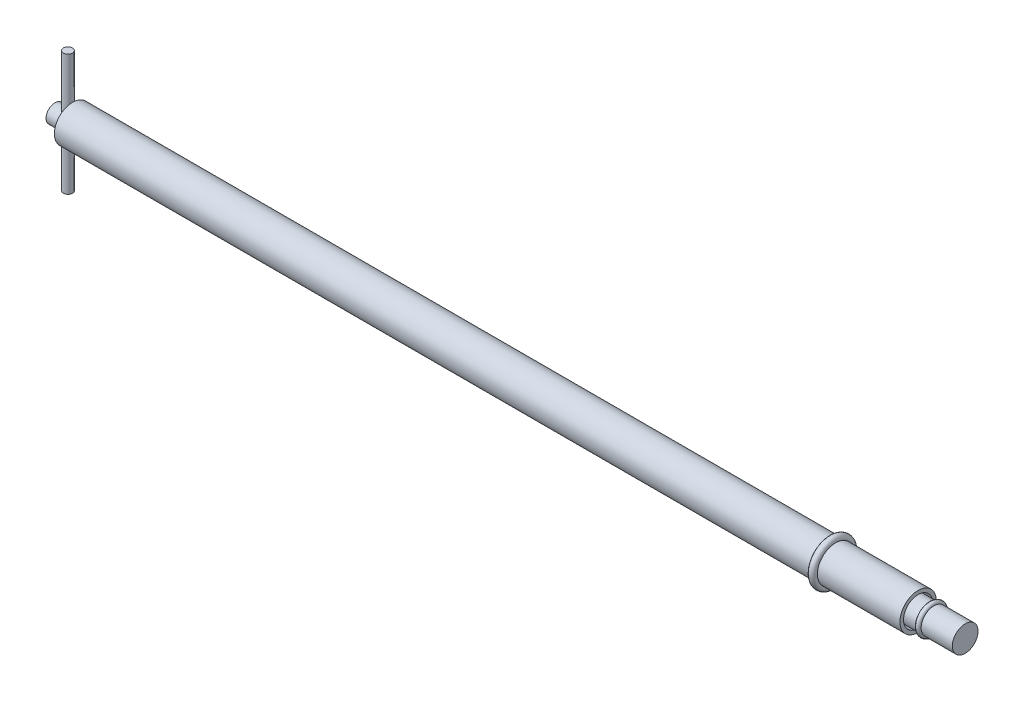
ISO-10303-21;
HEADER;
FILE_DESCRIPTION(('STEP AP214'),'2;1');
FILE_NAME('part.step','',(''),(''),'','','');
FILE_SCHEMA(('AUTOMOTIVE_DESIGN { 1 0 10303 214 1 1 1 1 }'));
ENDSEC;
DATA;
#1=APPLICATION_CONTEXT('core data for automotive mechanical design processes');
#2=APPLICATION_PROTOCOL_DEFINITION('international standard','automotive_design',2000,#1);
#3=PRODUCT_CONTEXT('',#1,'mechanical');
#4=PRODUCT('Part','Part','',(#3));
#5=PRODUCT_RELATED_PRODUCT_CATEGORY('part','',(#4));
#6=PRODUCT_DEFINITION_FORMATION('','',#4);
#7=PRODUCT_DEFINITION_CONTEXT('part definition',#1,'design');
#8=PRODUCT_DEFINITION('design','',#6,#7);
#9=PRODUCT_DEFINITION_SHAPE('','',#8);
#10=(LENGTH_UNIT() NAMED_UNIT(*) SI_UNIT(.MILLI.,.METRE.));
#11=(NAMED_UNIT(*) PLANE_ANGLE_UNIT() SI_UNIT($,.RADIAN.));
#12=(NAMED_UNIT(*) SI_UNIT($,.STERADIAN.) SOLID_ANGLE_UNIT());
#13=UNCERTAINTY_MEASURE_WITH_UNIT(LENGTH_MEASURE(1.E-05),#10,'distance_accuracy_value','');
#14=(GEOMETRIC_REPRESENTATION_CONTEXT(3) GLOBAL_UNCERTAINTY_ASSIGNED_CONTEXT((#13)) GLOBAL_UNIT_ASSIGNED_CONTEXT((#10,
#11,#12)) REPRESENTATION_CONTEXT('',''));
#15=CARTESIAN_POINT('',(0.,0.,0.));
#16=DIRECTION('',(0.,0.,1.));
#17=DIRECTION('',(1.,0.,0.));
#18=AXIS2_PLACEMENT_3D('',#15,#16,#17);
#19=CARTESIAN_POINT('',(0.,0.,0.));
#20=DIRECTION('',(1.,0.,0.));
#21=DIRECTION('',(0.,0.,-1.));
#22=AXIS2_PLACEMENT_3D('',#19,#20,#21);
#23=PLANE('',#22);
#24=CARTESIAN_POINT('',(0.,0.,0.));
#25=DIRECTION('',(-1.,0.,0.));
#26=DIRECTION('',(0.,0.,1.));
#27=AXIS2_PLACEMENT_3D('',#24,#25,#26);
#28=CIRCLE('',#27,2.96848884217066);
#29=CARTESIAN_POINT('',(0.,0.,2.96848884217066));
#30=VERTEX_POINT('',#29);
#31=EDGE_CURVE('E9',#30,#30,#28,.T.);
#32=ORIENTED_EDGE('',*,*,#31,.T.);
#33=EDGE_LOOP('',(#32));
#34=FACE_BOUND('',#33,.T.);
#35=ADVANCED_FACE('F14',(#34),#23,.F.);
#36=CARTESIAN_POINT('',(0.,0.,0.));
#37=DIRECTION('',(-1.,0.,0.));
#38=DIRECTION('',(0.,0.,1.));
#39=AXIS2_PLACEMENT_3D('',#36,#37,#38);
#40=CYLINDRICAL_SURFACE('',#39,2.96848884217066);
#41=CARTESIAN_POINT('',(4.2661907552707,-2.56162565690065,1.5));
#42=CARTESIAN_POINT('',(4.34422264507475,-2.56163267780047,1.4999944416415));
#43=CARTESIAN_POINT('',(4.42235011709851,-2.5652455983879,1.49387019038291));
#44=CARTESIAN_POINT('',(4.57619660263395,-2.57917019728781,1.46969018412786));
#45=CARTESIAN_POINT('',(4.65191032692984,-2.58949565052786,1.45160989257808));
#46=CARTESIAN_POINT('',(4.7984121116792,-2.61534051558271,1.40450365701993));
#47=CARTESIAN_POINT('',(4.86922439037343,-2.63083180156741,1.37553687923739));
#48=CARTESIAN_POINT('',(5.00496574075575,-2.66521903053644,1.3076607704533));
#49=CARTESIAN_POINT('',(5.06989438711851,-2.68411521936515,1.26875072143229));
#50=CARTESIAN_POINT('',(5.1980701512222,-2.72512943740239,1.17824574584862));
#51=CARTESIAN_POINT('',(5.26071360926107,-2.74738478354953,1.12585775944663));
#52=CARTESIAN_POINT('',(5.37679616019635,-2.79150219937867,1.01153200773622));
#53=CARTESIAN_POINT('',(5.43023057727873,-2.81336406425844,0.949589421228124));
#54=CARTESIAN_POINT('',(5.53000027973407,-2.85604040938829,0.812675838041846));
#55=CARTESIAN_POINT('',(5.57558830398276,-2.87667768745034,0.737099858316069));
#56=CARTESIAN_POINT('',(5.65312694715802,-2.91278858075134,0.57811281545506));
#57=CARTESIAN_POINT('',(5.68508635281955,-2.92826552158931,0.494706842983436));
#58=CARTESIAN_POINT('',(5.73205409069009,-2.95132082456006,0.328826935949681));
#59=CARTESIAN_POINT('',(5.74812234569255,-2.95939000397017,0.246722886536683));
#60=CARTESIAN_POINT('',(5.76634693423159,-2.96855664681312,0.0806187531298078));
#61=CARTESIAN_POINT('',(5.76851189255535,-2.96965843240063,-0.00338012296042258));
#62=CARTESIAN_POINT('',(5.75926674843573,-2.96499461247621,-0.162900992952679));
#63=CARTESIAN_POINT('',(5.74904466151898,-2.95982995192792,-0.238513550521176));
#64=CARTESIAN_POINT('',(5.71744812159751,-2.94412744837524,-0.386779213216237));
#65=CARTESIAN_POINT('',(5.69607283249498,-2.93358920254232,-0.459432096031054));
#66=CARTESIAN_POINT('',(5.64265046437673,-2.90792243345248,-0.600967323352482));
#67=CARTESIAN_POINT('',(5.6104622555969,-2.89273345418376,-0.669784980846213));
#68=CARTESIAN_POINT('',(5.53652935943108,-2.85912624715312,-0.801205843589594));
#69=CARTESIAN_POINT('',(5.49478127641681,-2.84070687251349,-0.863806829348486));
#70=CARTESIAN_POINT('',(5.39831355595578,-2.80027310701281,-0.987431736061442));
#71=CARTESIAN_POINT('',(5.34273339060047,-2.77808334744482,-1.04772730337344));
#72=CARTESIAN_POINT('',(5.22247589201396,-2.73373058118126,-1.15853905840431));
#73=CARTESIAN_POINT('',(5.15779137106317,-2.711567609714,-1.20904744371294));
#74=CARTESIAN_POINT('',(5.01595350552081,-2.66818702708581,-1.30211863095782));
#75=CARTESIAN_POINT('',(4.93825943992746,-2.64712790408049,-1.34393869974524));
#76=CARTESIAN_POINT('',(4.77563373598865,-2.61059724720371,-1.41360191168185));
#77=CARTESIAN_POINT('',(4.69070988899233,-2.59511979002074,-1.44145988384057));
#78=CARTESIAN_POINT('',(4.52314660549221,-2.5732516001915,-1.48012245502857));
#79=CARTESIAN_POINT('',(4.44086504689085,-2.5662346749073,-1.4921098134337));
#80=CARTESIAN_POINT('',(4.27518725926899,-2.56030791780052,-1.50226241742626));
#81=CARTESIAN_POINT('',(4.19179190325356,-2.56139207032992,-1.50043791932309));
#82=CARTESIAN_POINT('',(4.0363004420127,-2.57088003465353,-1.48410429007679));
#83=CARTESIAN_POINT('',(3.96399155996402,-2.57844372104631,-1.47105036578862));
#84=CARTESIAN_POINT('',(3.82273455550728,-2.5987858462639,-1.43480545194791));
#85=CARTESIAN_POINT('',(3.75378756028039,-2.61156602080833,-1.4116110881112));
#86=CARTESIAN_POINT('',(3.61758262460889,-2.64158935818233,-1.35462537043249));
#87=CARTESIAN_POINT('',(3.55054962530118,-2.65901132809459,-1.32039421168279));
#88=CARTESIAN_POINT('',(3.4227891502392,-2.69620279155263,-1.24268708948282));
#89=CARTESIAN_POINT('',(3.36206494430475,-2.71597349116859,-1.19920636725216));
#90=CARTESIAN_POINT('',(3.24042974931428,-2.75870627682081,-1.09766735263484));
#91=CARTESIAN_POINT('',(3.18050972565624,-2.78175048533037,-1.03845113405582));
#92=CARTESIAN_POINT('',(3.07113715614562,-2.82623083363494,-0.910458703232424));
#93=CARTESIAN_POINT('',(3.02168838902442,-2.84766639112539,-0.841679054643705));
#94=CARTESIAN_POINT('',(2.93345142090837,-2.88730330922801,-0.693843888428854));
#95=CARTESIAN_POINT('',(2.89500808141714,-2.90539479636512,-0.61455096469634));
#96=CARTESIAN_POINT('',(2.83239387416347,-2.93546253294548,-0.449446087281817));
#97=CARTESIAN_POINT('',(2.80821021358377,-2.94744426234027,-0.363640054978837));
#98=CARTESIAN_POINT('',(2.77692709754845,-2.96305064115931,-0.196555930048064));
#99=CARTESIAN_POINT('',(2.76844828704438,-2.96734871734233,-0.115598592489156));
#100=CARTESIAN_POINT('',(2.76472481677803,-2.96922900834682,0.046686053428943));
#101=CARTESIAN_POINT('',(2.76947531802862,-2.96681367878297,0.128013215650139));
#102=CARTESIAN_POINT('',(2.79117351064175,-2.95593044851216,0.282881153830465));
#103=CARTESIAN_POINT('',(2.80726716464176,-2.94788661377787,0.356574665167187));
#104=CARTESIAN_POINT('',(2.8500269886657,-2.92696073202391,0.500089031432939));
#105=CARTESIAN_POINT('',(2.87669464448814,-2.91407800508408,0.569909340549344));
#106=CARTESIAN_POINT('',(2.94100554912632,-2.88395591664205,0.70700699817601));
#107=CARTESIAN_POINT('',(2.97906392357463,-2.86655585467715,0.774053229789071));
#108=CARTESIAN_POINT('',(3.06455784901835,-2.82919949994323,0.901081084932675));
#109=CARTESIAN_POINT('',(3.11199768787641,-2.80924203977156,0.961059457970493));
#110=CARTESIAN_POINT('',(3.2204757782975,-2.76635443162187,1.0786621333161));
#111=CARTESIAN_POINT('',(3.28240495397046,-2.74332800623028,1.13543169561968));
#112=CARTESIAN_POINT('',(3.41521608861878,-2.69855126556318,1.23810027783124));
#113=CARTESIAN_POINT('',(3.48610617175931,-2.67680213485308,1.28398932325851));
#114=CARTESIAN_POINT('',(3.63807370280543,-2.63645767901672,1.36496837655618));
#115=CARTESIAN_POINT('',(3.71942032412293,-2.61799889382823,1.39962566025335));
#116=CARTESIAN_POINT('',(3.88798624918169,-2.5880823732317,1.45421765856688));
#117=CARTESIAN_POINT('',(3.97518486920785,-2.57660128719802,1.47420152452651));
#118=CARTESIAN_POINT('',(4.09717142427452,-2.56697512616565,1.49083314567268));
#119=CARTESIAN_POINT('',(4.13084530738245,-2.56497652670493,1.49426512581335));
#120=CARTESIAN_POINT('',(4.1984036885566,-2.56230022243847,1.49884983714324));
#121=CARTESIAN_POINT('',(4.23228820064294,-2.56162260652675,1.50000241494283));
#122=CARTESIAN_POINT('',(4.2661907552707,-2.56162565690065,1.5));
#123=B_SPLINE_CURVE_WITH_KNOTS('',3,(#41,#42,#43,#44,#45,#46,#47,#48,#49,#50,#51,#52,#53,#54,
#55,#56,#57,#58,#59,#60,#61,#62,#63,#64,#65,#66,#67,#68,#69,#70,#71,#72,#73,#74,#75,#76,#77,#78,
#79,#80,#81,#82,#83,#84,#85,#86,#87,#88,#89,#90,#91,#92,#93,#94,#95,#96,#97,#98,#99,#100,#101,
#102,#103,#104,#105,#106,#107,#108,#109,#110,#111,#112,#113,#114,#115,#116,#117,#118,#119,#120,
#121,#122),.UNSPECIFIED.,.T.,.F.,(4,2,2,2,2,2,2,2,2,2,2,2,2,2,2,2,2,2,2,2,2,2,2,2,2,2,2,2,2,2,2,
2,2,2,2,2,2,2,2,2,4),(0.,0.233952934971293,0.468387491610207,0.701565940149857,
0.934761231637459,1.18762397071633,1.44061472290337,1.71111458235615,1.98143977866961,
2.2321892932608,2.48278324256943,2.71113163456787,2.93949714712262,3.17096723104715,
3.40251966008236,3.65630154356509,3.91028491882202,4.18100181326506,4.45143056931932,
4.70029410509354,4.94897285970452,5.16957851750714,5.39025763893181,5.62112511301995,
5.85211165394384,6.11296325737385,6.37390883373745,6.64230820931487,6.91046642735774,
7.15369256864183,7.39682975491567,7.62338321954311,7.84996852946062,8.08610136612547,
8.32234237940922,8.58252752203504,8.8429502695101,9.1124607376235,9.38106425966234,
9.48270307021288,9.58434872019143),.UNSPECIFIED.);
#124=CARTESIAN_POINT('',(4.2661907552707,-2.56162565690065,1.5));
#125=VERTEX_POINT('',#124);
#126=EDGE_CURVE('E17',#125,#125,#123,.T.);
#127=ORIENTED_EDGE('',*,*,#126,.T.);
#128=EDGE_LOOP('',(#127));
#129=FACE_BOUND('',#128,.T.);
#130=CARTESIAN_POINT('',(4.2661907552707,2.56162565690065,1.5));
#131=CARTESIAN_POINT('',(4.18815886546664,2.56163267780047,1.4999944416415));
#132=CARTESIAN_POINT('',(4.11003139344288,2.5652455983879,1.49387019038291));
#133=CARTESIAN_POINT('',(3.95618490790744,2.57917019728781,1.46969018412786));
#134=CARTESIAN_POINT('',(3.88047118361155,2.58949565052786,1.45160989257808));
#135=CARTESIAN_POINT('',(3.73396939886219,2.61534051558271,1.40450365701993));
#136=CARTESIAN_POINT('',(3.66315712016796,2.63083180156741,1.37553687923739));
#137=CARTESIAN_POINT('',(3.52741576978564,2.66521903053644,1.3076607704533));
#138=CARTESIAN_POINT('',(3.46248712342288,2.68411521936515,1.26875072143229));
#139=CARTESIAN_POINT('',(3.33431135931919,2.72512943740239,1.17824574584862));
#140=CARTESIAN_POINT('',(3.27166790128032,2.74738478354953,1.12585775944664));
#141=CARTESIAN_POINT('',(3.15558535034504,2.79150219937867,1.01153200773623));
#142=CARTESIAN_POINT('',(3.10215093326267,2.81336406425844,0.949589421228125));
#143=CARTESIAN_POINT('',(3.00238123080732,2.85604040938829,0.812675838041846));
#144=CARTESIAN_POINT('',(2.95679320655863,2.87667768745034,0.73709985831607));
#145=CARTESIAN_POINT('',(2.87925456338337,2.91278858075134,0.578112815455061));
#146=CARTESIAN_POINT('',(2.84729515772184,2.92826552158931,0.494706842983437));
#147=CARTESIAN_POINT('',(2.8003274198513,2.95132082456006,0.328826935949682));
#148=CARTESIAN_POINT('',(2.78425916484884,2.95939000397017,0.246722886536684));
#149=CARTESIAN_POINT('',(2.7660345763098,2.96855664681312,0.0806187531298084));
#150=CARTESIAN_POINT('',(2.76386961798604,2.96965843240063,-0.00338012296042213));
#151=CARTESIAN_POINT('',(2.77311476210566,2.96499461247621,-0.162900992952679));
#152=CARTESIAN_POINT('',(2.78333684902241,2.95982995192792,-0.238513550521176));
#153=CARTESIAN_POINT('',(2.81493338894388,2.94412744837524,-0.386779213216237));
#154=CARTESIAN_POINT('',(2.83630867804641,2.93358920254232,-0.459432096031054));
#155=CARTESIAN_POINT('',(2.88973104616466,2.90792243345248,-0.600967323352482));
#156=CARTESIAN_POINT('',(2.92191925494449,2.89273345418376,-0.669784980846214));
#157=CARTESIAN_POINT('',(2.99585215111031,2.85912624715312,-0.801205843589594));
#158=CARTESIAN_POINT('',(3.03760023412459,2.84070687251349,-0.863806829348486));
#159=CARTESIAN_POINT('',(3.13406795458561,2.80027310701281,-0.987431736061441));
#160=CARTESIAN_POINT('',(3.18964811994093,2.77808334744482,-1.04772730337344));
#161=CARTESIAN_POINT('',(3.30990561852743,2.73373058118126,-1.15853905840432));
#162=CARTESIAN_POINT('',(3.37459013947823,2.711567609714,-1.20904744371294));
#163=CARTESIAN_POINT('',(3.51642800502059,2.66818702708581,-1.30211863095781));
#164=CARTESIAN_POINT('',(3.59412207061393,2.64712790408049,-1.34393869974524));
#165=CARTESIAN_POINT('',(3.75674777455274,2.6105972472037,-1.41360191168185));
#166=CARTESIAN_POINT('',(3.84167162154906,2.59511979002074,-1.44145988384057));
#167=CARTESIAN_POINT('',(4.00923490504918,2.5732516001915,-1.48012245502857));
#168=CARTESIAN_POINT('',(4.09151646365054,2.5662346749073,-1.4921098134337));
#169=CARTESIAN_POINT('',(4.2571942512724,2.56030791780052,-1.50226241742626));
#170=CARTESIAN_POINT('',(4.34058960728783,2.56139207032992,-1.50043791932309));
#171=CARTESIAN_POINT('',(4.49608106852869,2.57088003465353,-1.48410429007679));
#172=CARTESIAN_POINT('',(4.56838995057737,2.57844372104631,-1.47105036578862));
#173=CARTESIAN_POINT('',(4.70964695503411,2.59878584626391,-1.43480545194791));
#174=CARTESIAN_POINT('',(4.77859395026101,2.61156602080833,-1.4116110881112));
#175=CARTESIAN_POINT('',(4.9147988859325,2.64158935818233,-1.35462537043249));
#176=CARTESIAN_POINT('',(4.98183188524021,2.65901132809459,-1.32039421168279));
#177=CARTESIAN_POINT('',(5.10959236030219,2.69620279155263,-1.24268708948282));
#178=CARTESIAN_POINT('',(5.17031656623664,2.71597349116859,-1.19920636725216));
#179=CARTESIAN_POINT('',(5.29195176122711,2.75870627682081,-1.09766735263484));
#180=CARTESIAN_POINT('',(5.35187178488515,2.78175048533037,-1.03845113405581));
#181=CARTESIAN_POINT('',(5.46124435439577,2.82623083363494,-0.910458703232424));
#182=CARTESIAN_POINT('',(5.51069312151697,2.84766639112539,-0.841679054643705));
#183=CARTESIAN_POINT('',(5.59893008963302,2.88730330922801,-0.693843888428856));
#184=CARTESIAN_POINT('',(5.63737342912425,2.90539479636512,-0.614550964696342));
#185=CARTESIAN_POINT('',(5.69998763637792,2.93546253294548,-0.449446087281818));
#186=CARTESIAN_POINT('',(5.72417129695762,2.94744426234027,-0.363640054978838));
#187=CARTESIAN_POINT('',(5.75545441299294,2.96305064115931,-0.196555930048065));
#188=CARTESIAN_POINT('',(5.76393322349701,2.96734871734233,-0.115598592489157));
#189=CARTESIAN_POINT('',(5.76765669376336,2.96922900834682,0.0466860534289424));
#190=CARTESIAN_POINT('',(5.76290619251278,2.96681367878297,0.128013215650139));
#191=CARTESIAN_POINT('',(5.74120799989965,2.95593044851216,0.282881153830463));
#192=CARTESIAN_POINT('',(5.72511434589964,2.94788661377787,0.356574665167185));
#193=CARTESIAN_POINT('',(5.68235452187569,2.92696073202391,0.500089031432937));
#194=CARTESIAN_POINT('',(5.65568686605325,2.91407800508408,0.569909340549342));
#195=CARTESIAN_POINT('',(5.59137596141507,2.88395591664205,0.707006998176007));
#196=CARTESIAN_POINT('',(5.55331758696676,2.86655585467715,0.774053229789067));
#197=CARTESIAN_POINT('',(5.46782366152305,2.82919949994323,0.901081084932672));
#198=CARTESIAN_POINT('',(5.42038382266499,2.80924203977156,0.961059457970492));
#199=CARTESIAN_POINT('',(5.3119057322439,2.76635443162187,1.0786621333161));
#200=CARTESIAN_POINT('',(5.24997655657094,2.74332800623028,1.13543169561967));
#201=CARTESIAN_POINT('',(5.11716542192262,2.69855126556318,1.23810027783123));
#202=CARTESIAN_POINT('',(5.04627533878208,2.67680213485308,1.28398932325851));
#203=CARTESIAN_POINT('',(4.89430780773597,2.63645767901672,1.36496837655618));
#204=CARTESIAN_POINT('',(4.81296118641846,2.61799889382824,1.39962566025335));
#205=CARTESIAN_POINT('',(4.6443952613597,2.5880823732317,1.45421765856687));
#206=CARTESIAN_POINT('',(4.55719664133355,2.57660128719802,1.47420152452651));
#207=CARTESIAN_POINT('',(4.43521008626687,2.56697512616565,1.49083314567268));
#208=CARTESIAN_POINT('',(4.40153620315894,2.56497652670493,1.49426512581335));
#209=CARTESIAN_POINT('',(4.33397782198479,2.56230022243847,1.49884983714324));
#210=CARTESIAN_POINT('',(4.30009330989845,2.56162260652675,1.50000241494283));
#211=CARTESIAN_POINT('',(4.2661907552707,2.56162565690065,1.5));
#212=B_SPLINE_CURVE_WITH_KNOTS('',3,(#130,#131,#132,#133,#134,#135,#136,#137,#138,#139,#140,
#141,#142,#143,#144,#145,#146,#147,#148,#149,#150,#151,#152,#153,#154,#155,#156,#157,#158,#159,
#160,#161,#162,#163,#164,#165,#166,#167,#168,#169,#170,#171,#172,#173,#174,#175,#176,#177,#178,
#179,#180,#181,#182,#183,#184,#185,#186,#187,#188,#189,#190,#191,#192,#193,#194,#195,#196,#197,
#198,#199,#200,#201,#202,#203,#204,#205,#206,#207,#208,#209,#210,#211),.UNSPECIFIED.,.T.,.F.,(4,
2,2,2,2,2,2,2,2,2,2,2,2,2,2,2,2,2,2,2,2,2,2,2,2,2,2,2,2,2,2,2,2,2,2,2,2,2,2,2,4),(0.,
0.233952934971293,0.468387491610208,0.701565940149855,0.934761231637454,1.18762397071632,
1.44061472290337,1.71111458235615,1.98143977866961,2.2321892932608,2.48278324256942,
2.71113163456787,2.93949714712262,3.17096723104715,3.40251966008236,3.65630154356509,
3.91028491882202,4.18100181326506,4.45143056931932,4.70029410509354,4.94897285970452,
5.16957851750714,5.39025763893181,5.62112511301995,5.85211165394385,6.11296325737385,
6.37390883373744,6.64230820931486,6.91046642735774,7.15369256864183,7.39682975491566,
7.62338321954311,7.84996852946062,8.08610136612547,8.32234237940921,8.58252752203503,
8.8429502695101,9.1124607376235,9.38106425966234,9.48270307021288,9.58434872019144),.UNSPECIFIED.);
#213=CARTESIAN_POINT('',(4.2661907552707,2.56162565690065,1.5));
#214=VERTEX_POINT('',#213);
#215=EDGE_CURVE('E33',#214,#214,#212,.T.);
#216=ORIENTED_EDGE('',*,*,#215,.T.);
#217=EDGE_LOOP('',(#216));
#218=FACE_BOUND('',#217,.T.);
#219=ORIENTED_EDGE('',*,*,#31,.F.);
#220=EDGE_LOOP('',(#219));
#221=FACE_BOUND('',#220,.T.);
#222=CARTESIAN_POINT('',(5.7989899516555,0.,0.));
#223=DIRECTION('',(-1.,0.,0.));
#224=DIRECTION('',(0.,0.,1.));
#225=AXIS2_PLACEMENT_3D('',#222,#223,#224);
#226=CIRCLE('',#225,2.96848884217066);
#227=CARTESIAN_POINT('',(5.7989899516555,0.,2.96848884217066));
#228=VERTEX_POINT('',#227);
#229=EDGE_CURVE('E25',#228,#228,#226,.T.);
#230=ORIENTED_EDGE('',*,*,#229,.T.);
#231=EDGE_LOOP('',(#230));
#232=FACE_BOUND('',#231,.T.);
#233=ADVANCED_FACE('F39',(#129,#218,#221,#232),#40,.T.);
#234=CARTESIAN_POINT('',(5.7989899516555,2.96848884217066,0.));
#235=DIRECTION('',(1.,0.,0.));
#236=DIRECTION('',(0.,0.,-1.));
#237=AXIS2_PLACEMENT_3D('',#234,#235,#236);
#238=PLANE('',#237);
#239=ORIENTED_EDGE('',*,*,#229,.F.);
#240=EDGE_LOOP('',(#239));
#241=FACE_BOUND('',#240,.T.);
#242=CARTESIAN_POINT('',(5.7989899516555,0.,0.));
#243=DIRECTION('',(-1.,0.,0.));
#244=DIRECTION('',(0.,0.,1.));
#245=AXIS2_PLACEMENT_3D('',#242,#243,#244);
#246=CIRCLE('',#245,6.);
#247=CARTESIAN_POINT('',(5.7989899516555,0.,6.));
#248=VERTEX_POINT('',#247);
#249=EDGE_CURVE('E30',#248,#248,#246,.T.);
#250=ORIENTED_EDGE('',*,*,#249,.T.);
#251=EDGE_LOOP('',(#250));
#252=FACE_BOUND('',#251,.T.);
#253=ADVANCED_FACE('F91',(#241,#252),#238,.F.);
#254=CARTESIAN_POINT('',(0.,0.,0.));
#255=DIRECTION('',(-1.,0.,0.));
#256=DIRECTION('',(0.,0.,1.));
#257=AXIS2_PLACEMENT_3D('',#254,#255,#256);
#258=CYLINDRICAL_SURFACE('',#257,6.);
#259=ORIENTED_EDGE('',*,*,#249,.F.);
#260=EDGE_LOOP('',(#259));
#261=FACE_BOUND('',#260,.T.);
#262=CARTESIAN_POINT('',(255.262918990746,0.,0.));
#263=DIRECTION('',(-1.,0.,0.));
#264=DIRECTION('',(0.,0.,1.));
#265=AXIS2_PLACEMENT_3D('',#262,#263,#264);
#266=CIRCLE('',#265,6.);
#267=CARTESIAN_POINT('',(255.262918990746,0.,6.));
#268=VERTEX_POINT('',#267);
#269=EDGE_CURVE('E246',#268,#268,#266,.T.);
#270=ORIENTED_EDGE('',*,*,#269,.T.);
#271=EDGE_LOOP('',(#270));
#272=FACE_BOUND('',#271,.T.);
#273=ADVANCED_FACE('F88',(#261,#272),#258,.T.);
#274=CARTESIAN_POINT('',(256.279592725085,0.,0.));
#275=DIRECTION('',(-1.,0.,0.));
#276=DIRECTION('',(0.,0.,1.));
#277=AXIS2_PLACEMENT_3D('',#274,#275,#276);
#278=TOROIDAL_SURFACE('',#277,6.45662602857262,1.11451012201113);
#279=ORIENTED_EDGE('',*,*,#269,.F.);
#280=EDGE_LOOP('',(#279));
#281=FACE_BOUND('',#280,.T.);
#282=CARTESIAN_POINT('',(257.296266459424,0.,0.));
#283=DIRECTION('',(-1.,0.,0.));
#284=DIRECTION('',(0.,0.,1.));
#285=AXIS2_PLACEMENT_3D('',#282,#283,#284);
#286=CIRCLE('',#285,6.);
#287=CARTESIAN_POINT('',(257.296266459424,0.,6.));
#288=VERTEX_POINT('',#287);
#289=EDGE_CURVE('E243',#288,#288,#286,.T.);
#290=ORIENTED_EDGE('',*,*,#289,.T.);
#291=EDGE_LOOP('',(#290));
#292=FACE_BOUND('',#291,.T.);
#293=ADVANCED_FACE('F84',(#281,#292),#278,.T.);
#294=CARTESIAN_POINT('',(0.,0.,0.));
#295=DIRECTION('',(-1.,0.,0.));
#296=DIRECTION('',(0.,0.,1.));
#297=AXIS2_PLACEMENT_3D('',#294,#295,#296);
#298=CYLINDRICAL_SURFACE('',#297,6.);
#299=ORIENTED_EDGE('',*,*,#289,.F.);
#300=EDGE_LOOP('',(#299));
#301=FACE_BOUND('',#300,.T.);
#302=CARTESIAN_POINT('',(284.483646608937,0.,0.));
#303=DIRECTION('',(-1.,0.,0.));
#304=DIRECTION('',(0.,0.,1.));
#305=AXIS2_PLACEMENT_3D('',#302,#303,#304);
#306=CIRCLE('',#305,6.);
#307=CARTESIAN_POINT('',(284.483646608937,0.,6.));
#308=VERTEX_POINT('',#307);
#309=EDGE_CURVE('E240',#308,#308,#306,.T.);
#310=ORIENTED_EDGE('',*,*,#309,.T.);
#311=EDGE_LOOP('',(#310));
#312=FACE_BOUND('',#311,.T.);
#313=ADVANCED_FACE('F80',(#301,#312),#298,.T.);
#314=CARTESIAN_POINT('',(284.483646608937,6.,0.));
#315=DIRECTION('',(-1.,0.,0.));
#316=DIRECTION('',(0.,0.,1.));
#317=AXIS2_PLACEMENT_3D('',#314,#315,#316);
#318=PLANE('',#317);
#319=ORIENTED_EDGE('',*,*,#309,.F.);
#320=EDGE_LOOP('',(#319));
#321=FACE_BOUND('',#320,.T.);
#322=CARTESIAN_POINT('',(284.483646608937,0.,0.));
#323=DIRECTION('',(-1.,0.,0.));
#324=DIRECTION('',(0.,0.,1.));
#325=AXIS2_PLACEMENT_3D('',#322,#323,#324);
#326=CIRCLE('',#325,4.81549285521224);
#327=CARTESIAN_POINT('',(284.483646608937,0.,4.81549285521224));
#328=VERTEX_POINT('',#327);
#329=EDGE_CURVE('E237',#328,#328,#326,.T.);
#330=ORIENTED_EDGE('',*,*,#329,.T.);
#331=EDGE_LOOP('',(#330));
#332=FACE_BOUND('',#331,.T.);
#333=ADVANCED_FACE('F76',(#321,#332),#318,.F.);
#334=CARTESIAN_POINT('',(0.,0.,0.));
#335=DIRECTION('',(-1.,0.,0.));
#336=DIRECTION('',(0.,0.,1.));
#337=AXIS2_PLACEMENT_3D('',#334,#335,#336);
#338=CYLINDRICAL_SURFACE('',#337,4.81549285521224);
#339=ORIENTED_EDGE('',*,*,#329,.F.);
#340=EDGE_LOOP('',(#339));
#341=FACE_BOUND('',#340,.T.);
#342=CARTESIAN_POINT('',(280.736974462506,0.,0.));
#343=DIRECTION('',(-1.,0.,0.));
#344=DIRECTION('',(0.,0.,1.));
#345=AXIS2_PLACEMENT_3D('',#342,#343,#344);
#346=CIRCLE('',#345,4.81549285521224);
#347=CARTESIAN_POINT('',(280.736974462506,0.,4.81549285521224));
#348=VERTEX_POINT('',#347);
#349=EDGE_CURVE('E234',#348,#348,#346,.T.);
#350=ORIENTED_EDGE('',*,*,#349,.T.);
#351=EDGE_LOOP('',(#350));
#352=FACE_BOUND('',#351,.T.);
#353=ADVANCED_FACE('F72',(#341,#352),#338,.F.);
#354=CARTESIAN_POINT('',(280.736974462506,4.81549285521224,0.));
#355=DIRECTION('',(-1.,0.,0.));
#356=DIRECTION('',(0.,0.,1.));
#357=AXIS2_PLACEMENT_3D('',#354,#355,#356);
#358=PLANE('',#357);
#359=ORIENTED_EDGE('',*,*,#349,.F.);
#360=EDGE_LOOP('',(#359));
#361=FACE_BOUND('',#360,.T.);
#362=CARTESIAN_POINT('',(280.736974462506,0.,0.));
#363=DIRECTION('',(-1.,0.,0.));
#364=DIRECTION('',(0.,0.,1.));
#365=AXIS2_PLACEMENT_3D('',#362,#363,#364);
#366=CIRCLE('',#365,4.2325225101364);
#367=CARTESIAN_POINT('',(280.736974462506,0.,4.2325225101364));
#368=VERTEX_POINT('',#367);
#369=EDGE_CURVE('E231',#368,#368,#366,.T.);
#370=ORIENTED_EDGE('',*,*,#369,.T.);
#371=EDGE_LOOP('',(#370));
#372=FACE_BOUND('',#371,.T.);
#373=ADVANCED_FACE('F68',(#361,#372),#358,.F.);
#374=CARTESIAN_POINT('',(0.,0.,0.));
#375=DIRECTION('',(-1.,0.,0.));
#376=DIRECTION('',(0.,0.,1.));
#377=AXIS2_PLACEMENT_3D('',#374,#375,#376);
#378=CYLINDRICAL_SURFACE('',#377,4.2325225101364);
#379=ORIENTED_EDGE('',*,*,#369,.F.);
#380=EDGE_LOOP('',(#379));
#381=FACE_BOUND('',#380,.T.);
#382=CARTESIAN_POINT('',(288.128988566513,0.,0.));
#383=DIRECTION('',(-1.,0.,0.));
#384=DIRECTION('',(0.,0.,1.));
#385=AXIS2_PLACEMENT_3D('',#382,#383,#384);
#386=CIRCLE('',#385,4.2325225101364);
#387=CARTESIAN_POINT('',(288.128988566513,0.,4.2325225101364));
#388=VERTEX_POINT('',#387);
#389=EDGE_CURVE('E228',#388,#388,#386,.T.);
#390=ORIENTED_EDGE('',*,*,#389,.T.);
#391=EDGE_LOOP('',(#390));
#392=FACE_BOUND('',#391,.T.);
#393=ADVANCED_FACE('F64',(#381,#392),#378,.T.);
#394=CARTESIAN_POINT('',(288.919773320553,0.,0.));
#395=DIRECTION('',(-1.,0.,0.));
#396=DIRECTION('',(0.,0.,1.));
#397=AXIS2_PLACEMENT_3D('',#394,#395,#396);
#398=TOROIDAL_SURFACE('',#397,4.2325225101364,0.79078475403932);
#399=ORIENTED_EDGE('',*,*,#389,.F.);
#400=EDGE_LOOP('',(#399));
#401=FACE_BOUND('',#400,.T.);
#402=CARTESIAN_POINT('',(289.710558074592,0.,0.));
#403=DIRECTION('',(-1.,0.,0.));
#404=DIRECTION('',(0.,0.,1.));
#405=AXIS2_PLACEMENT_3D('',#402,#403,#404);
#406=CIRCLE('',#405,4.2325225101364);
#407=CARTESIAN_POINT('',(289.710558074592,0.,4.2325225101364));
#408=VERTEX_POINT('',#407);
#409=EDGE_CURVE('E225',#408,#408,#406,.T.);
#410=ORIENTED_EDGE('',*,*,#409,.T.);
#411=EDGE_LOOP('',(#410));
#412=FACE_BOUND('',#411,.T.);
#413=ADVANCED_FACE('F60',(#401,#412),#398,.T.);
#414=CARTESIAN_POINT('',(0.,0.,0.));
#415=DIRECTION('',(-1.,0.,0.));
#416=DIRECTION('',(0.,0.,1.));
#417=AXIS2_PLACEMENT_3D('',#414,#415,#416);
#418=CYLINDRICAL_SURFACE('',#417,4.2325225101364);
#419=ORIENTED_EDGE('',*,*,#409,.F.);
#420=EDGE_LOOP('',(#419));
#421=FACE_BOUND('',#420,.T.);
#422=CARTESIAN_POINT('',(300.,0.,0.));
#423=DIRECTION('',(-1.,0.,0.));
#424=DIRECTION('',(0.,0.,1.));
#425=AXIS2_PLACEMENT_3D('',#422,#423,#424);
#426=CIRCLE('',#425,4.2325225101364);
#427=CARTESIAN_POINT('',(300.,0.,4.2325225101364));
#428=VERTEX_POINT('',#427);
#429=EDGE_CURVE('E222',#428,#428,#426,.T.);
#430=ORIENTED_EDGE('',*,*,#429,.T.);
#431=EDGE_LOOP('',(#430));
#432=FACE_BOUND('',#431,.T.);
#433=ADVANCED_FACE('F56',(#421,#432),#418,.T.);
#434=CARTESIAN_POINT('',(300.,4.2325225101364,0.));
#435=DIRECTION('',(-1.,0.,0.));
#436=DIRECTION('',(0.,0.,1.));
#437=AXIS2_PLACEMENT_3D('',#434,#435,#436);
#438=PLANE('',#437);
#439=ORIENTED_EDGE('',*,*,#429,.F.);
#440=EDGE_LOOP('',(#439));
#441=FACE_BOUND('',#440,.T.);
#442=ADVANCED_FACE('F51',(#441),#438,.F.);
#443=CARTESIAN_POINT('',(4.2661907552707,20.,0.));
#444=DIRECTION('',(0.,1.,0.));
#445=DIRECTION('',(0.,0.,1.));
#446=AXIS2_PLACEMENT_3D('',#443,#444,#445);
#447=PLANE('',#446);
#448=CARTESIAN_POINT('',(4.2661907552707,20.,0.));
#449=DIRECTION('',(0.,1.,0.));
#450=DIRECTION('',(0.,0.,1.));
#451=AXIS2_PLACEMENT_3D('',#448,#449,#450);
#452=CIRCLE('',#451,1.5);
#453=CARTESIAN_POINT('',(4.2661907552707,20.,1.5));
#454=VERTEX_POINT('',#453);
#455=EDGE_CURVE('E217',#454,#454,#452,.T.);
#456=ORIENTED_EDGE('',*,*,#455,.T.);
#457=EDGE_LOOP('',(#456));
#458=FACE_BOUND('',#457,.T.);
#459=ADVANCED_FACE('F55',(#458),#447,.T.);
#460=CARTESIAN_POINT('',(4.2661907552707,-20.,0.));
#461=DIRECTION('',(0.,1.,0.));
#462=DIRECTION('',(0.,0.,1.));
#463=AXIS2_PLACEMENT_3D('',#460,#461,#462);
#464=CYLINDRICAL_SURFACE('',#463,1.5);
#465=ORIENTED_EDGE('',*,*,#455,.F.);
#466=EDGE_LOOP('',(#465));
#467=FACE_BOUND('',#466,.T.);
#468=ORIENTED_EDGE('',*,*,#215,.F.);
#469=EDGE_LOOP('',(#468));
#470=FACE_BOUND('',#469,.T.);
#471=ADVANCED_FACE('F48',(#467,#470),#464,.T.);
#472=CARTESIAN_POINT('',(4.2661907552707,-20.,0.));
#473=DIRECTION('',(0.,1.,0.));
#474=DIRECTION('',(0.,0.,1.));
#475=AXIS2_PLACEMENT_3D('',#472,#473,#474);
#476=CIRCLE('',#475,1.5);
#477=CARTESIAN_POINT('',(4.2661907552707,-20.,1.5));
#478=VERTEX_POINT('',#477);
#479=EDGE_CURVE('E38',#478,#478,#476,.T.);
#480=ORIENTED_EDGE('',*,*,#479,.T.);
#481=EDGE_LOOP('',(#480));
#482=FACE_BOUND('',#481,.T.);
#483=ORIENTED_EDGE('',*,*,#126,.F.);
#484=EDGE_LOOP('',(#483));
#485=FACE_BOUND('',#484,.T.);
#486=ADVANCED_FACE('F42',(#482,#485),#464,.T.);
#487=CARTESIAN_POINT('',(4.2661907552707,-20.,0.));
#488=DIRECTION('',(0.,1.,0.));
#489=DIRECTION('',(0.,0.,1.));
#490=AXIS2_PLACEMENT_3D('',#487,#488,#489);
#491=PLANE('',#490);
#492=ORIENTED_EDGE('',*,*,#479,.F.);
#493=EDGE_LOOP('',(#492));
#494=FACE_BOUND('',#493,.T.);
#495=ADVANCED_FACE('F47',(#494),#491,.F.);
#496=CLOSED_SHELL('',(#35,#233,#253,#273,#293,#313,#333,#353,#373,#393,#413,#433,#442,#459,#471,
#486,#495));
#497=MANIFOLD_SOLID_BREP('B1',#496);
#498=ADVANCED_BREP_SHAPE_REPRESENTATION('',(#18,#497),#14);
#499=SHAPE_DEFINITION_REPRESENTATION(#9,#498);
ENDSEC;
END-ISO-10303-21;
